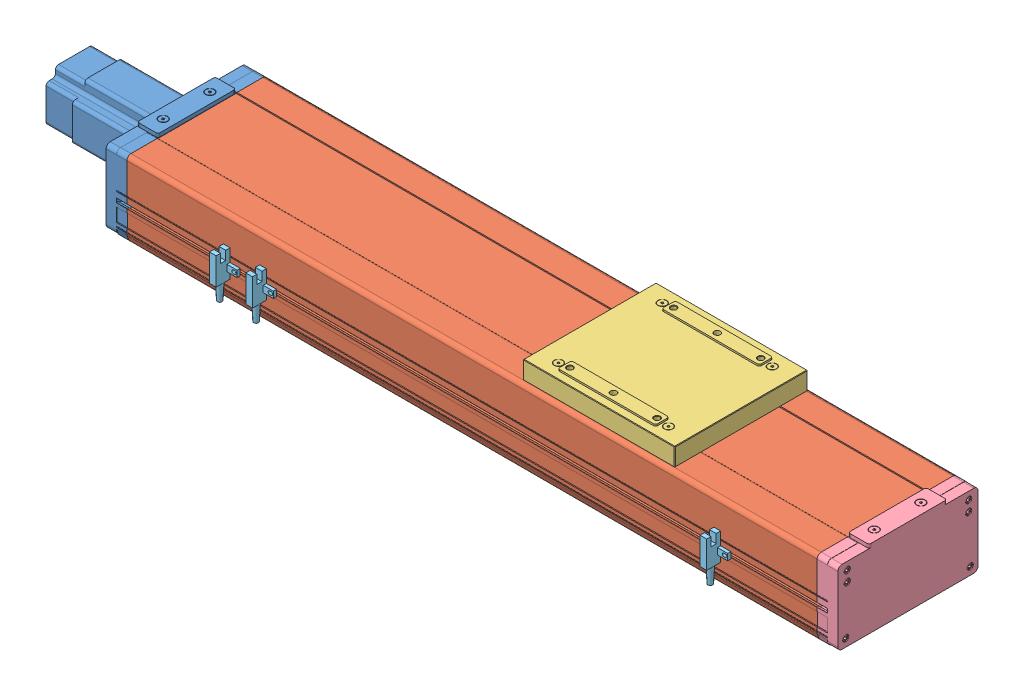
SolidWorks assembly TCD135-P-ZFL-0.SLDASM, configuration 450 (file format 9000). Lengths in mm.
Overall size (803.41 91 148.43).
7 component instances, 5 part files, 19 mates.
Components (placement in the parent):
- TCD135-P-ZFL-1-1: TCD135-P-ZFL-1.sldprt [默认] at origin
- TCD135-P-ZFL-4-1: TCD135-P-ZFL-4.SLDPRT [450] at (-325 1.5 0) x (0 0 -1) z (1 0 0) size (135 71.7 665)
- TCD135-P-ZFL-3-1: TCD135-P-ZFL-3.sldprt [默认] at (126.3279 35.4 0) x (0 0 -1) z (1 0 0)
- TCD135-P-ZFL-2-1: TCD135-P-ZFL-2.sldprt [默认] at (15 -0.1 0)
- TCD135-P-ZFL-5-1: TCD135-P-ZFL-5.sldprt [默认] at (-85.3004 -3.7004 11) x (0 0 1) z (-1 0 0)
- TCD135-P-ZFL-5-2: TCD135-P-ZFL-5.sldprt [默认] at (387.2996 -3.7004 11) x (0 0 1) z (-1 0 0)
- TCD135-P-ZFL-5-3: TCD135-P-ZFL-5.sldprt [默认] at (-50.3004 -3.7004 11) x (0 0 1) z (-1 0 0)
Mates (geometry in assembly coordinates):
- 重合1: coincident aligned: plane of TCD135-P-ZFL-4-1 through (340 -0.1 65.16) normal (0 -1 0); plane of TCD135-P-ZFL-1-1 through (-330 -0.1 49.63) normal (0 -1 0)
- 重合2: coincident aligned: plane of TCD135-P-ZFL-4-1 through (340 67.6 67.5) normal (0 0 1); plane of TCD135-P-ZFL-1-1 through (-335 36.05 67.5) normal (0 0 1)
- 重合3: coincident anti-aligned: plane of TCD135-P-ZFL-4-1 through (-325 67.6 63.5) normal (-1 0 0); plane of TCD135-P-ZFL-1-1 through (-325 35.75 0) normal (1 0 0)
- 重合4: coincident anti-aligned: plane of TCD135-P-ZFL-4-1 through (340 67.6 63.5) normal (1 0 0); plane of TCD135-P-ZFL-2-1 through (340 35.75 0) normal (-1 0 0)
- 重合5: coincident aligned: plane of TCD135-P-ZFL-4-1 through (340 67.6 67.5) normal (0 0 1); plane of TCD135-P-ZFL-2-1 through (350 36 67.5) normal (0 0 1)
- 重合6: coincident aligned: plane of TCD135-P-ZFL-4-1 through (340 -0.1 65.16) normal (0 -1 0); plane of TCD135-P-ZFL-2-1 through (345 -0.1 49.63) normal (0 -1 0)
- 距离1: distance = 3.5 mm aligned: plane of TCD135-P-ZFL-3-1 through (126.3279 80.65 64) normal (0 0 1); plane of TCD135-P-ZFL-4-1 through (340 67.6 67.5) normal (0 0 1)
- 距离2: distance = 91 mm anti-aligned: plane of TCD135-P-ZFL-3-1 through (126.3279 90.9 50) normal (0 1 0); plane of TCD135-P-ZFL-4-1 through (340 -0.1 65.16) normal (0 -1 0)
- LimitDistance1: limit distance = 160.6721 mm aligned: plane of TCD135-P-ZFL-3-1 through (199.3279 80.65 0) normal (1 0 0); plane of TCD135-P-ZFL-2-1 through (360 37.65 0) normal (1 0 0)
- LimitDistance2: limit distance = 398.3279 mm aligned: plane of TCD135-P-ZFL-3-1 through (53.3279 80.65 0) normal (-1 0 0); plane of TCD135-P-ZFL-1-1 through (-345 37.75 0) normal (-1 0 0)
- 重合7: coincident anti-aligned: plane of TCD135-P-ZFL-4-1 through (340 11 67.5) normal (0 0 1); plane of TCD135-P-ZFL-5-1 through (-241.8 18.5 67.5) normal (0 0 -1)
- 重合8: coincident aligned: plane of TCD135-P-ZFL-4-1 through (340 27.7 65.8) normal (0 1 0); plane of TCD135-P-ZFL-5-1 through (-238.3367 27.7 67.5) normal (0 1 0)
- 重合9: coincident anti-aligned: plane of TCD135-P-ZFL-4-1 through (340 11 67.5) normal (0 0 1); plane of TCD135-P-ZFL-5-2 through (230.8 18.5 67.5) normal (0 0 -1)
- 重合10: coincident aligned: plane of TCD135-P-ZFL-4-1 through (340 27.7 65.8) normal (0 1 0); plane of TCD135-P-ZFL-5-2 through (234.2633 27.7 67.5) normal (0 1 0)
- 重合11: coincident anti-aligned: plane of TCD135-P-ZFL-4-1 through (340 11 67.5) normal (0 0 1); plane of TCD135-P-ZFL-5-3 through (-206.8 18.5 67.5) normal (0 0 -1)
- 重合12: coincident aligned: plane of TCD135-P-ZFL-4-1 through (340 27.7 65.8) normal (0 1 0); plane of TCD135-P-ZFL-5-3 through (-203.3367 27.7 67.5) normal (0 1 0)
- 距离3: distance = 35 mm aligned: plane of TCD135-P-ZFL-5-3 through (-197 18.5 67.5) normal (-1 0 0); plane of TCD135-P-ZFL-5-1 through (-232 18.5 67.5) normal (-1 0 0)
- 距离4: distance = 113 mm aligned: plane of TCD135-P-ZFL-5-1 through (-232 18.5 67.5) normal (-1 0 0); plane of TCD135-P-ZFL-1-1 through (-345 37.75 0) normal (-1 0 0)
- 距离5: distance = 113 mm aligned: plane of TCD135-P-ZFL-5-2 through (247 18.5 67.5) normal (1 0 0); plane of TCD135-P-ZFL-2-1 through (360 37.65 0) normal (1 0 0)
